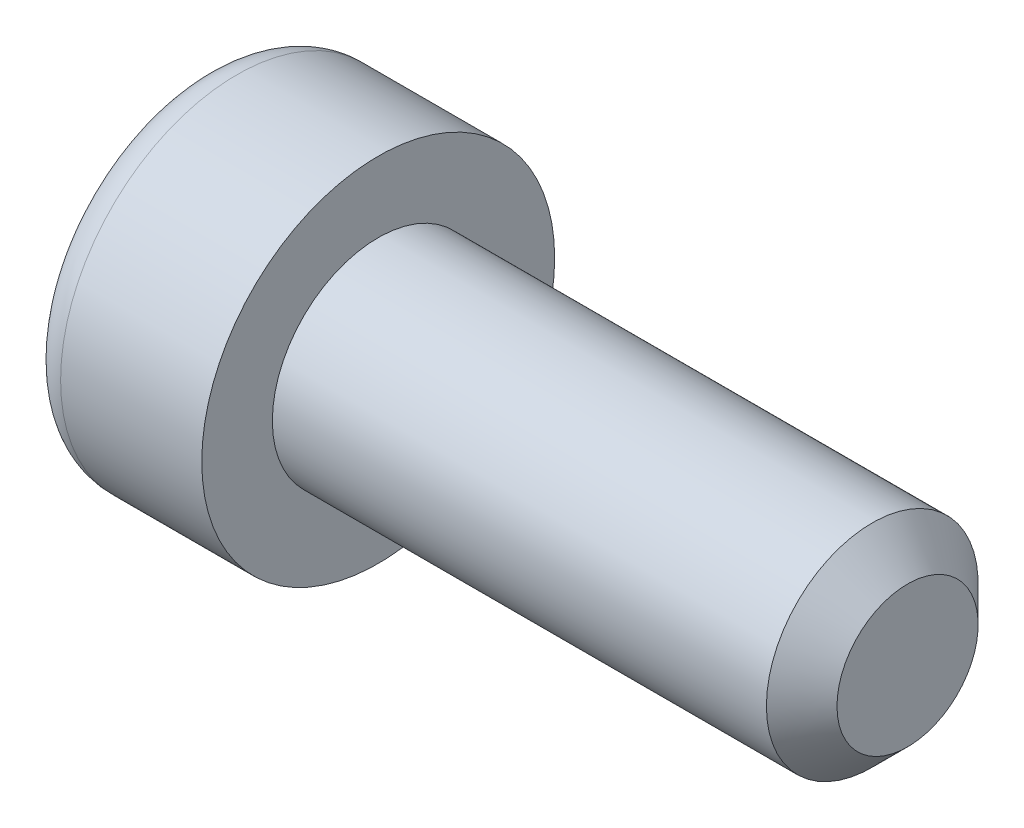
from build123d import *

# Parameters (mm, degrees)
ENL_V_MAT_EXTRU_1_DEPTH = 3


with BuildPart() as part:
    # Esquisse1 → R_volution1 (revolve)
    with BuildSketch(Plane.XY, mode=Mode.PRIVATE) as r_volution1_sk:
        with BuildLine():
            Line((41.305464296, 0), (41.305464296, 2))
            Line((41.305464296, 2), (40.305464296, 3))
            Line((40.305464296, 3), (26.305464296, 3))
            Line((26.305464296, 3), (26.305464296, 5))
            Line((26.305464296, 5), (22.305464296, 5))
            ThreePointArc((22.305464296, 5), (21.598357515, 4.707106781), (21.305464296, 4))
            Line((21.305464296, 4), (21.305464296, 0))
            Line((21.305464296, 0), (41.305464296, 0))
        make_face()
    revolve(r_volution1_sk.sketch.rotate(Axis((-45.608623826, 0, 0), (1, 0, 0)), 90), axis=Axis((-45.608623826, 0, 0), (1, 0, 0)))

    # Esquisse2 → Enl_v. mat.-Extru.1 (cut)
    with BuildSketch(Plane.ZY.offset(-21.305464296)):
        Polygon((0, 2.235751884), (-1.936217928, 1.117875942), (-1.936217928, -1.117875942), (0, -2.235751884), (1.936217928, -1.117875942), (1.936217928, 1.117875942), align=None)
    extrude(amount=-ENL_V_MAT_EXTRU_1_DEPTH, mode=Mode.SUBTRACT)


solid = part.part
